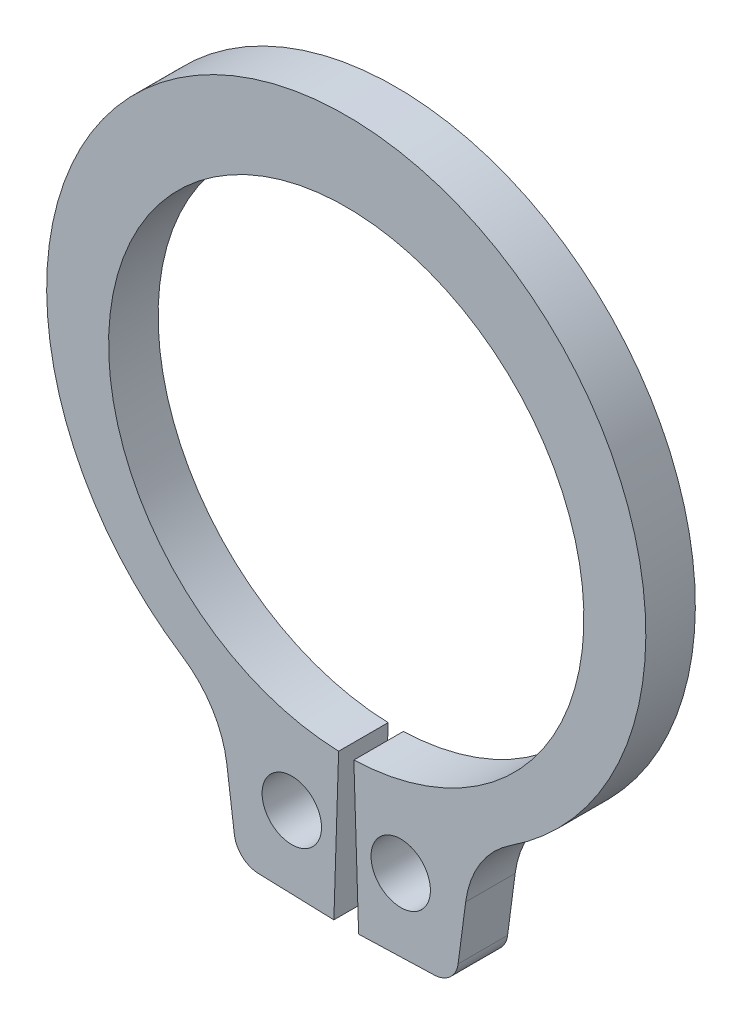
ISO-10303-21;
HEADER;
FILE_DESCRIPTION(('STEP AP214'),'2;1');
FILE_NAME('part.step','',(''),(''),'','','');
FILE_SCHEMA(('AUTOMOTIVE_DESIGN { 1 0 10303 214 1 1 1 1 }'));
ENDSEC;
DATA;
#1=APPLICATION_CONTEXT('core data for automotive mechanical design processes');
#2=APPLICATION_PROTOCOL_DEFINITION('international standard','automotive_design',2000,#1);
#3=PRODUCT_CONTEXT('',#1,'mechanical');
#4=PRODUCT('Part','Part','',(#3));
#5=PRODUCT_RELATED_PRODUCT_CATEGORY('part','',(#4));
#6=PRODUCT_DEFINITION_FORMATION('','',#4);
#7=PRODUCT_DEFINITION_CONTEXT('part definition',#1,'design');
#8=PRODUCT_DEFINITION('design','',#6,#7);
#9=PRODUCT_DEFINITION_SHAPE('','',#8);
#10=(LENGTH_UNIT() NAMED_UNIT(*) SI_UNIT(.MILLI.,.METRE.));
#11=(NAMED_UNIT(*) PLANE_ANGLE_UNIT() SI_UNIT($,.RADIAN.));
#12=(NAMED_UNIT(*) SI_UNIT($,.STERADIAN.) SOLID_ANGLE_UNIT());
#13=UNCERTAINTY_MEASURE_WITH_UNIT(LENGTH_MEASURE(1.E-05),#10,'distance_accuracy_value','');
#14=(GEOMETRIC_REPRESENTATION_CONTEXT(3) GLOBAL_UNCERTAINTY_ASSIGNED_CONTEXT((#13)) GLOBAL_UNIT_ASSIGNED_CONTEXT((#10,
#11,#12)) REPRESENTATION_CONTEXT('',''));
#15=CARTESIAN_POINT('',(0.,0.,0.));
#16=DIRECTION('',(0.,0.,1.));
#17=DIRECTION('',(1.,0.,0.));
#18=AXIS2_PLACEMENT_3D('',#15,#16,#17);
#19=CARTESIAN_POINT('',(0.,0.,-1.));
#20=DIRECTION('',(0.,0.,1.));
#21=DIRECTION('',(1.,0.,0.));
#22=AXIS2_PLACEMENT_3D('',#19,#20,#21);
#23=CYLINDRICAL_SURFACE('',#22,4.8);
#24=CARTESIAN_POINT('',(0.,0.,0.));
#25=DIRECTION('',(0.,0.,-1.));
#26=DIRECTION('',(1.,0.,0.));
#27=AXIS2_PLACEMENT_3D('',#24,#25,#26);
#28=CIRCLE('',#27,4.8);
#29=CARTESIAN_POINT('',(-0.153846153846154,-4.79753388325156,0.));
#30=VERTEX_POINT('',#29);
#31=CARTESIAN_POINT('',(0.153846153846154,-4.79753388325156,0.));
#32=VERTEX_POINT('',#31);
#33=EDGE_CURVE('E160',#30,#32,#28,.T.);
#34=ORIENTED_EDGE('',*,*,#33,.F.);
#35=DIRECTION('',(0.,0.,1.));
#36=VECTOR('',#35,1.);
#37=CARTESIAN_POINT('',(-0.153846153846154,-4.79753388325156,-1.));
#38=LINE('',#37,#36);
#39=CARTESIAN_POINT('',(-0.153846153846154,-4.79753388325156,-1.));
#40=VERTEX_POINT('',#39);
#41=EDGE_CURVE('E11',#40,#30,#38,.T.);
#42=ORIENTED_EDGE('',*,*,#41,.F.);
#43=CARTESIAN_POINT('',(0.,0.,-1.));
#44=DIRECTION('',(0.,0.,-1.));
#45=DIRECTION('',(1.,0.,0.));
#46=AXIS2_PLACEMENT_3D('',#43,#44,#45);
#47=CIRCLE('',#46,4.8);
#48=CARTESIAN_POINT('',(0.153846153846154,-4.79753388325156,-1.));
#49=VERTEX_POINT('',#48);
#50=EDGE_CURVE('E193',#40,#49,#47,.T.);
#51=ORIENTED_EDGE('',*,*,#50,.T.);
#52=DIRECTION('',(0.,0.,1.));
#53=VECTOR('',#52,1.);
#54=CARTESIAN_POINT('',(0.153846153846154,-4.79753388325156,-1.));
#55=LINE('',#54,#53);
#56=EDGE_CURVE('E42',#49,#32,#55,.T.);
#57=ORIENTED_EDGE('',*,*,#56,.T.);
#58=EDGE_LOOP('',(#34,#42,#51,#57));
#59=FACE_BOUND('',#58,.T.);
#60=ADVANCED_FACE('F39',(#59),#23,.F.);
#61=CARTESIAN_POINT('',(-0.153846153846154,-4.79753388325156,-1.));
#62=DIRECTION('',(0.999486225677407,-0.0320512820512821,0.));
#63=DIRECTION('',(0.0320512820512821,0.999486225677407,0.));
#64=AXIS2_PLACEMENT_3D('',#61,#62,#63);
#65=PLANE('',#64);
#66=DIRECTION('',(0.0320512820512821,0.999486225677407,0.));
#67=VECTOR('',#66,1.);
#68=CARTESIAN_POINT('',(-0.153846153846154,-4.79753388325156,0.));
#69=LINE('',#68,#67);
#70=CARTESIAN_POINT('',(-0.25,-7.79599256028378,0.));
#71=VERTEX_POINT('',#70);
#72=EDGE_CURVE('E191',#71,#30,#69,.T.);
#73=ORIENTED_EDGE('',*,*,#72,.F.);
#74=DIRECTION('',(0.,0.,1.));
#75=VECTOR('',#74,1.);
#76=CARTESIAN_POINT('',(-0.25,-7.79599256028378,-1.));
#77=LINE('',#76,#75);
#78=CARTESIAN_POINT('',(-0.25,-7.79599256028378,-1.));
#79=VERTEX_POINT('',#78);
#80=EDGE_CURVE('E48',#79,#71,#77,.T.);
#81=ORIENTED_EDGE('',*,*,#80,.F.);
#82=DIRECTION('',(0.0320512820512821,0.999486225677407,0.));
#83=VECTOR('',#82,1.);
#84=CARTESIAN_POINT('',(-0.153846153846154,-4.79753388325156,-1.));
#85=LINE('',#84,#83);
#86=EDGE_CURVE('E150',#79,#40,#85,.T.);
#87=ORIENTED_EDGE('',*,*,#86,.T.);
#88=ORIENTED_EDGE('',*,*,#41,.T.);
#89=EDGE_LOOP('',(#73,#81,#87,#88));
#90=FACE_BOUND('',#89,.T.);
#91=ADVANCED_FACE('F213',(#90),#65,.T.);
#92=CARTESIAN_POINT('',(-0.25,-7.79599256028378,-1.));
#93=DIRECTION('',(-0.0320512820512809,-0.999486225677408,0.));
#94=DIRECTION('',(0.999486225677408,-0.0320512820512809,0.));
#95=AXIS2_PLACEMENT_3D('',#92,#93,#94);
#96=PLANE('',#95);
#97=DIRECTION('',(0.999486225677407,-0.0320512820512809,0.));
#98=VECTOR('',#97,1.);
#99=CARTESIAN_POINT('',(-0.25,-7.79599256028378,0.));
#100=LINE('',#99,#98);
#101=CARTESIAN_POINT('',(-1.77924534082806,-7.74695309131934,0.));
#102=VERTEX_POINT('',#101);
#103=EDGE_CURVE('E137',#102,#71,#100,.T.);
#104=ORIENTED_EDGE('',*,*,#103,.F.);
#105=DIRECTION('',(0.,0.,1.));
#106=VECTOR('',#105,1.);
#107=CARTESIAN_POINT('',(-1.77924534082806,-7.74695309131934,-1.));
#108=LINE('',#107,#106);
#109=CARTESIAN_POINT('',(-1.77924534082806,-7.74695309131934,-1.));
#110=VERTEX_POINT('',#109);
#111=EDGE_CURVE('E132',#110,#102,#108,.T.);
#112=ORIENTED_EDGE('',*,*,#111,.F.);
#113=DIRECTION('',(0.999486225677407,-0.0320512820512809,0.));
#114=VECTOR('',#113,1.);
#115=CARTESIAN_POINT('',(-0.25,-7.79599256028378,-1.));
#116=LINE('',#115,#114);
#117=EDGE_CURVE('E135',#110,#79,#116,.T.);
#118=ORIENTED_EDGE('',*,*,#117,.T.);
#119=ORIENTED_EDGE('',*,*,#80,.T.);
#120=EDGE_LOOP('',(#104,#112,#118,#119));
#121=FACE_BOUND('',#120,.T.);
#122=ADVANCED_FACE('F134',(#121),#96,.T.);
#123=CARTESIAN_POINT('',(-1.76321969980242,-7.24720997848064,-1.));
#124=DIRECTION('',(0.,0.,1.));
#125=DIRECTION('',(1.,0.,0.));
#126=AXIS2_PLACEMENT_3D('',#123,#124,#125);
#127=CYLINDRICAL_SURFACE('',#126,0.5);
#128=CARTESIAN_POINT('',(-1.76321969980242,-7.24720997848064,0.));
#129=DIRECTION('',(0.,0.,1.));
#130=DIRECTION('',(1.,0.,0.));
#131=AXIS2_PLACEMENT_3D('',#128,#129,#130);
#132=CIRCLE('',#131,0.5);
#133=CARTESIAN_POINT('',(-2.25894213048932,-7.31247307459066,0.));
#134=VERTEX_POINT('',#133);
#135=EDGE_CURVE('E188',#134,#102,#132,.T.);
#136=ORIENTED_EDGE('',*,*,#135,.F.);
#137=DIRECTION('',(0.,0.,1.));
#138=VECTOR('',#137,1.);
#139=CARTESIAN_POINT('',(-2.25894213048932,-7.31247307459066,-1.));
#140=LINE('',#139,#138);
#141=CARTESIAN_POINT('',(-2.25894213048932,-7.31247307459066,-1.));
#142=VERTEX_POINT('',#141);
#143=EDGE_CURVE('E142',#142,#134,#140,.T.);
#144=ORIENTED_EDGE('',*,*,#143,.F.);
#145=CARTESIAN_POINT('',(-1.76321969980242,-7.24720997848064,-1.));
#146=DIRECTION('',(0.,0.,1.));
#147=DIRECTION('',(1.,0.,0.));
#148=AXIS2_PLACEMENT_3D('',#145,#146,#147);
#149=CIRCLE('',#148,0.5);
#150=EDGE_CURVE('E148',#142,#110,#149,.T.);
#151=ORIENTED_EDGE('',*,*,#150,.T.);
#152=ORIENTED_EDGE('',*,*,#111,.T.);
#153=EDGE_LOOP('',(#136,#144,#151,#152));
#154=FACE_BOUND('',#153,.T.);
#155=ADVANCED_FACE('F152',(#154),#127,.T.);
#156=CARTESIAN_POINT('',(-2.41181577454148,-6.15128246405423,-1.));
#157=DIRECTION('',(-0.99144486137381,-0.130526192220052,0.));
#158=DIRECTION('',(0.130526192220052,-0.99144486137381,0.));
#159=AXIS2_PLACEMENT_3D('',#156,#157,#158);
#160=PLANE('',#159);
#161=DIRECTION('',(0.130526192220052,-0.99144486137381,0.));
#162=VECTOR('',#161,1.);
#163=CARTESIAN_POINT('',(-2.41181577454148,-6.15128246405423,0.));
#164=LINE('',#163,#162);
#165=CARTESIAN_POINT('',(-2.41181577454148,-6.15128246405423,0.));
#166=VERTEX_POINT('',#165);
#167=EDGE_CURVE('E185',#166,#134,#164,.T.);
#168=ORIENTED_EDGE('',*,*,#167,.F.);
#169=DIRECTION('',(0.,0.,1.));
#170=VECTOR('',#169,1.);
#171=CARTESIAN_POINT('',(-2.41181577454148,-6.15128246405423,-1.));
#172=LINE('',#171,#170);
#173=CARTESIAN_POINT('',(-2.41181577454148,-6.15128246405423,-1.));
#174=VERTEX_POINT('',#173);
#175=EDGE_CURVE('E197',#174,#166,#172,.T.);
#176=ORIENTED_EDGE('',*,*,#175,.F.);
#177=DIRECTION('',(0.130526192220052,-0.99144486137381,0.));
#178=VECTOR('',#177,1.);
#179=CARTESIAN_POINT('',(-2.41181577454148,-6.15128246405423,-1.));
#180=LINE('',#179,#178);
#181=EDGE_CURVE('E153',#174,#142,#180,.T.);
#182=ORIENTED_EDGE('',*,*,#181,.T.);
#183=ORIENTED_EDGE('',*,*,#143,.T.);
#184=EDGE_LOOP('',(#168,#176,#182,#183));
#185=FACE_BOUND('',#184,.T.);
#186=ADVANCED_FACE('F226',(#185),#160,.T.);
#187=CARTESIAN_POINT('',(-4.43354857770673,-6.41744863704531,-1.));
#188=DIRECTION('',(0.,0.,1.));
#189=DIRECTION('',(1.,0.,0.));
#190=AXIS2_PLACEMENT_3D('',#187,#188,#189);
#191=CYLINDRICAL_SURFACE('',#190,2.03917825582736);
#192=CARTESIAN_POINT('',(-4.43354857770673,-6.41744863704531,0.));
#193=DIRECTION('',(0.,0.,-1.));
#194=DIRECTION('',(1.,0.,0.));
#195=AXIS2_PLACEMENT_3D('',#192,#193,#194);
#196=CIRCLE('',#195,2.03917825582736);
#197=CARTESIAN_POINT('',(-3.31600032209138,-4.7117716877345,0.));
#198=VERTEX_POINT('',#197);
#199=EDGE_CURVE('E182',#198,#166,#196,.T.);
#200=ORIENTED_EDGE('',*,*,#199,.F.);
#201=DIRECTION('',(0.,0.,1.));
#202=VECTOR('',#201,1.);
#203=CARTESIAN_POINT('',(-3.31600032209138,-4.7117716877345,-1.));
#204=LINE('',#203,#202);
#205=CARTESIAN_POINT('',(-3.31600032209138,-4.7117716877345,-1.));
#206=VERTEX_POINT('',#205);
#207=EDGE_CURVE('E199',#206,#198,#204,.T.);
#208=ORIENTED_EDGE('',*,*,#207,.F.);
#209=CARTESIAN_POINT('',(-4.43354857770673,-6.41744863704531,-1.));
#210=DIRECTION('',(0.,0.,-1.));
#211=DIRECTION('',(1.,0.,0.));
#212=AXIS2_PLACEMENT_3D('',#209,#210,#211);
#213=CIRCLE('',#212,2.03917825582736);
#214=EDGE_CURVE('E155',#206,#174,#213,.T.);
#215=ORIENTED_EDGE('',*,*,#214,.T.);
#216=ORIENTED_EDGE('',*,*,#175,.T.);
#217=EDGE_LOOP('',(#200,#208,#215,#216));
#218=FACE_BOUND('',#217,.T.);
#219=ADVANCED_FACE('F229',(#218),#191,.F.);
#220=CARTESIAN_POINT('',(0.,0.349329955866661,-1.));
#221=DIRECTION('',(0.,0.,1.));
#222=DIRECTION('',(1.,0.,0.));
#223=AXIS2_PLACEMENT_3D('',#220,#221,#222);
#224=CYLINDRICAL_SURFACE('',#223,6.05067004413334);
#225=CARTESIAN_POINT('',(0.,0.349329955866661,0.));
#226=DIRECTION('',(0.,0.,1.));
#227=DIRECTION('',(1.,0.,0.));
#228=AXIS2_PLACEMENT_3D('',#225,#226,#227);
#229=CIRCLE('',#228,6.05067004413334);
#230=CARTESIAN_POINT('',(3.31600032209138,-4.71177168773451,0.));
#231=VERTEX_POINT('',#230);
#232=EDGE_CURVE('E179',#231,#198,#229,.T.);
#233=ORIENTED_EDGE('',*,*,#232,.F.);
#234=DIRECTION('',(0.,0.,1.));
#235=VECTOR('',#234,1.);
#236=CARTESIAN_POINT('',(3.31600032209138,-4.71177168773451,-1.));
#237=LINE('',#236,#235);
#238=CARTESIAN_POINT('',(3.31600032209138,-4.71177168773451,-1.));
#239=VERTEX_POINT('',#238);
#240=EDGE_CURVE('E201',#239,#231,#237,.T.);
#241=ORIENTED_EDGE('',*,*,#240,.F.);
#242=CARTESIAN_POINT('',(0.,0.349329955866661,-1.));
#243=DIRECTION('',(0.,0.,1.));
#244=DIRECTION('',(1.,0.,0.));
#245=AXIS2_PLACEMENT_3D('',#242,#243,#244);
#246=CIRCLE('',#245,6.05067004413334);
#247=EDGE_CURVE('E303',#239,#206,#246,.T.);
#248=ORIENTED_EDGE('',*,*,#247,.T.);
#249=ORIENTED_EDGE('',*,*,#207,.T.);
#250=EDGE_LOOP('',(#233,#241,#248,#249));
#251=FACE_BOUND('',#250,.T.);
#252=ADVANCED_FACE('F233',(#251),#224,.T.);
#253=CARTESIAN_POINT('',(4.43354857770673,-6.41744863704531,-1.));
#254=DIRECTION('',(0.,0.,1.));
#255=DIRECTION('',(1.,0.,0.));
#256=AXIS2_PLACEMENT_3D('',#253,#254,#255);
#257=CYLINDRICAL_SURFACE('',#256,2.03917825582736);
#258=CARTESIAN_POINT('',(4.43354857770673,-6.41744863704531,0.));
#259=DIRECTION('',(0.,0.,-1.));
#260=DIRECTION('',(1.,0.,0.));
#261=AXIS2_PLACEMENT_3D('',#258,#259,#260);
#262=CIRCLE('',#261,2.03917825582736);
#263=CARTESIAN_POINT('',(2.41181577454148,-6.15128246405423,0.));
#264=VERTEX_POINT('',#263);
#265=EDGE_CURVE('E176',#264,#231,#262,.T.);
#266=ORIENTED_EDGE('',*,*,#265,.F.);
#267=DIRECTION('',(0.,0.,1.));
#268=VECTOR('',#267,1.);
#269=CARTESIAN_POINT('',(2.41181577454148,-6.15128246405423,-1.));
#270=LINE('',#269,#268);
#271=CARTESIAN_POINT('',(2.41181577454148,-6.15128246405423,-1.));
#272=VERTEX_POINT('',#271);
#273=EDGE_CURVE('E203',#272,#264,#270,.T.);
#274=ORIENTED_EDGE('',*,*,#273,.F.);
#275=CARTESIAN_POINT('',(4.43354857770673,-6.41744863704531,-1.));
#276=DIRECTION('',(0.,0.,-1.));
#277=DIRECTION('',(1.,0.,0.));
#278=AXIS2_PLACEMENT_3D('',#275,#276,#277);
#279=CIRCLE('',#278,2.03917825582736);
#280=EDGE_CURVE('E300',#272,#239,#279,.T.);
#281=ORIENTED_EDGE('',*,*,#280,.T.);
#282=ORIENTED_EDGE('',*,*,#240,.T.);
#283=EDGE_LOOP('',(#266,#274,#281,#282));
#284=FACE_BOUND('',#283,.T.);
#285=ADVANCED_FACE('F237',(#284),#257,.F.);
#286=CARTESIAN_POINT('',(2.41181577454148,-6.15128246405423,-1.));
#287=DIRECTION('',(0.99144486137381,-0.130526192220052,0.));
#288=DIRECTION('',(0.130526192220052,0.99144486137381,0.));
#289=AXIS2_PLACEMENT_3D('',#286,#287,#288);
#290=PLANE('',#289);
#291=DIRECTION('',(0.130526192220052,0.99144486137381,0.));
#292=VECTOR('',#291,1.);
#293=CARTESIAN_POINT('',(2.41181577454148,-6.15128246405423,0.));
#294=LINE('',#293,#292);
#295=CARTESIAN_POINT('',(2.25894213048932,-7.31247307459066,0.));
#296=VERTEX_POINT('',#295);
#297=EDGE_CURVE('E173',#296,#264,#294,.T.);
#298=ORIENTED_EDGE('',*,*,#297,.F.);
#299=DIRECTION('',(0.,0.,1.));
#300=VECTOR('',#299,1.);
#301=CARTESIAN_POINT('',(2.25894213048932,-7.31247307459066,-1.));
#302=LINE('',#301,#300);
#303=CARTESIAN_POINT('',(2.25894213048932,-7.31247307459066,-1.));
#304=VERTEX_POINT('',#303);
#305=EDGE_CURVE('E205',#304,#296,#302,.T.);
#306=ORIENTED_EDGE('',*,*,#305,.F.);
#307=DIRECTION('',(0.130526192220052,0.99144486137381,0.));
#308=VECTOR('',#307,1.);
#309=CARTESIAN_POINT('',(2.41181577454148,-6.15128246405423,-1.));
#310=LINE('',#309,#308);
#311=EDGE_CURVE('E297',#304,#272,#310,.T.);
#312=ORIENTED_EDGE('',*,*,#311,.T.);
#313=ORIENTED_EDGE('',*,*,#273,.T.);
#314=EDGE_LOOP('',(#298,#306,#312,#313));
#315=FACE_BOUND('',#314,.T.);
#316=ADVANCED_FACE('F241',(#315),#290,.T.);
#317=CARTESIAN_POINT('',(1.76321969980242,-7.24720997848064,-1.));
#318=DIRECTION('',(0.,0.,1.));
#319=DIRECTION('',(1.,0.,0.));
#320=AXIS2_PLACEMENT_3D('',#317,#318,#319);
#321=CYLINDRICAL_SURFACE('',#320,0.5);
#322=CARTESIAN_POINT('',(1.76321969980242,-7.24720997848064,0.));
#323=DIRECTION('',(0.,0.,1.));
#324=DIRECTION('',(-1.,0.,0.));
#325=AXIS2_PLACEMENT_3D('',#322,#323,#324);
#326=CIRCLE('',#325,0.5);
#327=CARTESIAN_POINT('',(1.77924534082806,-7.74695309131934,0.));
#328=VERTEX_POINT('',#327);
#329=EDGE_CURVE('E170',#328,#296,#326,.T.);
#330=ORIENTED_EDGE('',*,*,#329,.F.);
#331=DIRECTION('',(0.,0.,1.));
#332=VECTOR('',#331,1.);
#333=CARTESIAN_POINT('',(1.77924534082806,-7.74695309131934,-1.));
#334=LINE('',#333,#332);
#335=CARTESIAN_POINT('',(1.77924534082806,-7.74695309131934,-1.));
#336=VERTEX_POINT('',#335);
#337=EDGE_CURVE('E207',#336,#328,#334,.T.);
#338=ORIENTED_EDGE('',*,*,#337,.F.);
#339=CARTESIAN_POINT('',(1.76321969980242,-7.24720997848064,-1.));
#340=DIRECTION('',(0.,0.,1.));
#341=DIRECTION('',(-1.,0.,0.));
#342=AXIS2_PLACEMENT_3D('',#339,#340,#341);
#343=CIRCLE('',#342,0.5);
#344=EDGE_CURVE('E294',#336,#304,#343,.T.);
#345=ORIENTED_EDGE('',*,*,#344,.T.);
#346=ORIENTED_EDGE('',*,*,#305,.T.);
#347=EDGE_LOOP('',(#330,#338,#345,#346));
#348=FACE_BOUND('',#347,.T.);
#349=ADVANCED_FACE('F245',(#348),#321,.T.);
#350=CARTESIAN_POINT('',(0.25,-7.79599256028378,-1.));
#351=DIRECTION('',(0.0320512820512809,-0.999486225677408,0.));
#352=DIRECTION('',(0.999486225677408,0.0320512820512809,0.));
#353=AXIS2_PLACEMENT_3D('',#350,#351,#352);
#354=PLANE('',#353);
#355=DIRECTION('',(0.999486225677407,0.0320512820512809,0.));
#356=VECTOR('',#355,1.);
#357=CARTESIAN_POINT('',(0.25,-7.79599256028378,0.));
#358=LINE('',#357,#356);
#359=CARTESIAN_POINT('',(0.25,-7.79599256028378,0.));
#360=VERTEX_POINT('',#359);
#361=EDGE_CURVE('E167',#360,#328,#358,.T.);
#362=ORIENTED_EDGE('',*,*,#361,.F.);
#363=DIRECTION('',(0.,0.,1.));
#364=VECTOR('',#363,1.);
#365=CARTESIAN_POINT('',(0.25,-7.79599256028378,-1.));
#366=LINE('',#365,#364);
#367=CARTESIAN_POINT('',(0.25,-7.79599256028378,-1.));
#368=VERTEX_POINT('',#367);
#369=EDGE_CURVE('E208',#368,#360,#366,.T.);
#370=ORIENTED_EDGE('',*,*,#369,.F.);
#371=DIRECTION('',(0.999486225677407,0.0320512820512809,0.));
#372=VECTOR('',#371,1.);
#373=CARTESIAN_POINT('',(0.25,-7.79599256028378,-1.));
#374=LINE('',#373,#372);
#375=EDGE_CURVE('E291',#368,#336,#374,.T.);
#376=ORIENTED_EDGE('',*,*,#375,.T.);
#377=ORIENTED_EDGE('',*,*,#337,.T.);
#378=EDGE_LOOP('',(#362,#370,#376,#377));
#379=FACE_BOUND('',#378,.T.);
#380=ADVANCED_FACE('F249',(#379),#354,.T.);
#381=CARTESIAN_POINT('',(0.153846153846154,-4.79753388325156,-1.));
#382=DIRECTION('',(-0.999486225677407,-0.0320512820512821,0.));
#383=DIRECTION('',(0.0320512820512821,-0.999486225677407,0.));
#384=AXIS2_PLACEMENT_3D('',#381,#382,#383);
#385=PLANE('',#384);
#386=DIRECTION('',(0.0320512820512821,-0.999486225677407,0.));
#387=VECTOR('',#386,1.);
#388=CARTESIAN_POINT('',(0.153846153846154,-4.79753388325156,0.));
#389=LINE('',#388,#387);
#390=EDGE_CURVE('E163',#32,#360,#389,.T.);
#391=ORIENTED_EDGE('',*,*,#390,.F.);
#392=ORIENTED_EDGE('',*,*,#56,.F.);
#393=DIRECTION('',(0.0320512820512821,-0.999486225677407,0.));
#394=VECTOR('',#393,1.);
#395=CARTESIAN_POINT('',(0.153846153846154,-4.79753388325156,-1.));
#396=LINE('',#395,#394);
#397=EDGE_CURVE('E289',#49,#368,#396,.T.);
#398=ORIENTED_EDGE('',*,*,#397,.T.);
#399=ORIENTED_EDGE('',*,*,#369,.T.);
#400=EDGE_LOOP('',(#391,#392,#398,#399));
#401=FACE_BOUND('',#400,.T.);
#402=ADVANCED_FACE('F210',(#401),#385,.T.);
#403=CARTESIAN_POINT('',(0.,0.,-1.));
#404=DIRECTION('',(0.,0.,1.));
#405=DIRECTION('',(1.,0.,0.));
#406=AXIS2_PLACEMENT_3D('',#403,#404,#405);
#407=PLANE('',#406);
#408=CARTESIAN_POINT('',(-1.1,-6.30476010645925,-1.));
#409=DIRECTION('',(0.,0.,1.));
#410=DIRECTION('',(1.,0.,0.));
#411=AXIS2_PLACEMENT_3D('',#408,#409,#410);
#412=CIRCLE('',#411,0.6);
#413=CARTESIAN_POINT('',(-0.5,-6.30476010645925,-1.));
#414=VERTEX_POINT('',#413);
#415=EDGE_CURVE('E276',#414,#414,#412,.T.);
#416=ORIENTED_EDGE('',*,*,#415,.T.);
#417=EDGE_LOOP('',(#416));
#418=FACE_BOUND('',#417,.T.);
#419=CARTESIAN_POINT('',(1.1,-6.30476010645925,-1.));
#420=DIRECTION('',(0.,0.,1.));
#421=DIRECTION('',(1.,0.,0.));
#422=AXIS2_PLACEMENT_3D('',#419,#420,#421);
#423=CIRCLE('',#422,0.6);
#424=CARTESIAN_POINT('',(1.7,-6.30476010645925,-1.));
#425=VERTEX_POINT('',#424);
#426=EDGE_CURVE('E164',#425,#425,#423,.T.);
#427=ORIENTED_EDGE('',*,*,#426,.T.);
#428=EDGE_LOOP('',(#427));
#429=FACE_BOUND('',#428,.T.);
#430=ORIENTED_EDGE('',*,*,#50,.F.);
#431=ORIENTED_EDGE('',*,*,#86,.F.);
#432=ORIENTED_EDGE('',*,*,#117,.F.);
#433=ORIENTED_EDGE('',*,*,#150,.F.);
#434=ORIENTED_EDGE('',*,*,#181,.F.);
#435=ORIENTED_EDGE('',*,*,#214,.F.);
#436=ORIENTED_EDGE('',*,*,#247,.F.);
#437=ORIENTED_EDGE('',*,*,#280,.F.);
#438=ORIENTED_EDGE('',*,*,#311,.F.);
#439=ORIENTED_EDGE('',*,*,#344,.F.);
#440=ORIENTED_EDGE('',*,*,#375,.F.);
#441=ORIENTED_EDGE('',*,*,#397,.F.);
#442=EDGE_LOOP('',(#430,#431,#432,#433,#434,#435,#436,#437,#438,#439,#440,#441));
#443=FACE_BOUND('',#442,.T.);
#444=ADVANCED_FACE('F146',(#418,#429,#443),#407,.F.);
#445=CARTESIAN_POINT('',(0.,0.,0.));
#446=DIRECTION('',(0.,0.,1.));
#447=DIRECTION('',(1.,0.,0.));
#448=AXIS2_PLACEMENT_3D('',#445,#446,#447);
#449=PLANE('',#448);
#450=CARTESIAN_POINT('',(-1.1,-6.30476010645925,0.));
#451=DIRECTION('',(0.,0.,1.));
#452=DIRECTION('',(1.,0.,0.));
#453=AXIS2_PLACEMENT_3D('',#450,#451,#452);
#454=CIRCLE('',#453,0.6);
#455=CARTESIAN_POINT('',(-0.5,-6.30476010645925,0.));
#456=VERTEX_POINT('',#455);
#457=EDGE_CURVE('E279',#456,#456,#454,.T.);
#458=ORIENTED_EDGE('',*,*,#457,.F.);
#459=EDGE_LOOP('',(#458));
#460=FACE_BOUND('',#459,.T.);
#461=CARTESIAN_POINT('',(1.1,-6.30476010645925,0.));
#462=DIRECTION('',(0.,0.,1.));
#463=DIRECTION('',(1.,0.,0.));
#464=AXIS2_PLACEMENT_3D('',#461,#462,#463);
#465=CIRCLE('',#464,0.6);
#466=CARTESIAN_POINT('',(1.7,-6.30476010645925,0.));
#467=VERTEX_POINT('',#466);
#468=EDGE_CURVE('E281',#467,#467,#465,.T.);
#469=ORIENTED_EDGE('',*,*,#468,.F.);
#470=EDGE_LOOP('',(#469));
#471=FACE_BOUND('',#470,.T.);
#472=ORIENTED_EDGE('',*,*,#33,.T.);
#473=ORIENTED_EDGE('',*,*,#390,.T.);
#474=ORIENTED_EDGE('',*,*,#361,.T.);
#475=ORIENTED_EDGE('',*,*,#329,.T.);
#476=ORIENTED_EDGE('',*,*,#297,.T.);
#477=ORIENTED_EDGE('',*,*,#265,.T.);
#478=ORIENTED_EDGE('',*,*,#232,.T.);
#479=ORIENTED_EDGE('',*,*,#199,.T.);
#480=ORIENTED_EDGE('',*,*,#167,.T.);
#481=ORIENTED_EDGE('',*,*,#135,.T.);
#482=ORIENTED_EDGE('',*,*,#103,.T.);
#483=ORIENTED_EDGE('',*,*,#72,.T.);
#484=EDGE_LOOP('',(#472,#473,#474,#475,#476,#477,#478,#479,#480,#481,#482,#483));
#485=FACE_BOUND('',#484,.T.);
#486=ADVANCED_FACE('F212',(#460,#471,#485),#449,.T.);
#487=CARTESIAN_POINT('',(1.1,-6.30476010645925,-1.));
#488=DIRECTION('',(0.,0.,1.));
#489=DIRECTION('',(1.,0.,0.));
#490=AXIS2_PLACEMENT_3D('',#487,#488,#489);
#491=CYLINDRICAL_SURFACE('',#490,0.6);
#492=ORIENTED_EDGE('',*,*,#426,.F.);
#493=EDGE_LOOP('',(#492));
#494=FACE_BOUND('',#493,.T.);
#495=ORIENTED_EDGE('',*,*,#468,.T.);
#496=EDGE_LOOP('',(#495));
#497=FACE_BOUND('',#496,.T.);
#498=ADVANCED_FACE('F261',(#494,#497),#491,.F.);
#499=CARTESIAN_POINT('',(-1.1,-6.30476010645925,-1.));
#500=DIRECTION('',(0.,0.,1.));
#501=DIRECTION('',(1.,0.,0.));
#502=AXIS2_PLACEMENT_3D('',#499,#500,#501);
#503=CYLINDRICAL_SURFACE('',#502,0.6);
#504=ORIENTED_EDGE('',*,*,#415,.F.);
#505=EDGE_LOOP('',(#504));
#506=FACE_BOUND('',#505,.T.);
#507=ORIENTED_EDGE('',*,*,#457,.T.);
#508=EDGE_LOOP('',(#507));
#509=FACE_BOUND('',#508,.T.);
#510=ADVANCED_FACE('F268',(#506,#509),#503,.F.);
#511=CLOSED_SHELL('',(#60,#91,#122,#155,#186,#219,#252,#285,#316,#349,#380,#402,#444,#486,#498,#510));
#512=MANIFOLD_SOLID_BREP('B2',#511);
#513=ADVANCED_BREP_SHAPE_REPRESENTATION('',(#18,#512),#14);
#514=SHAPE_DEFINITION_REPRESENTATION(#9,#513);
ENDSEC;
END-ISO-10303-21;
